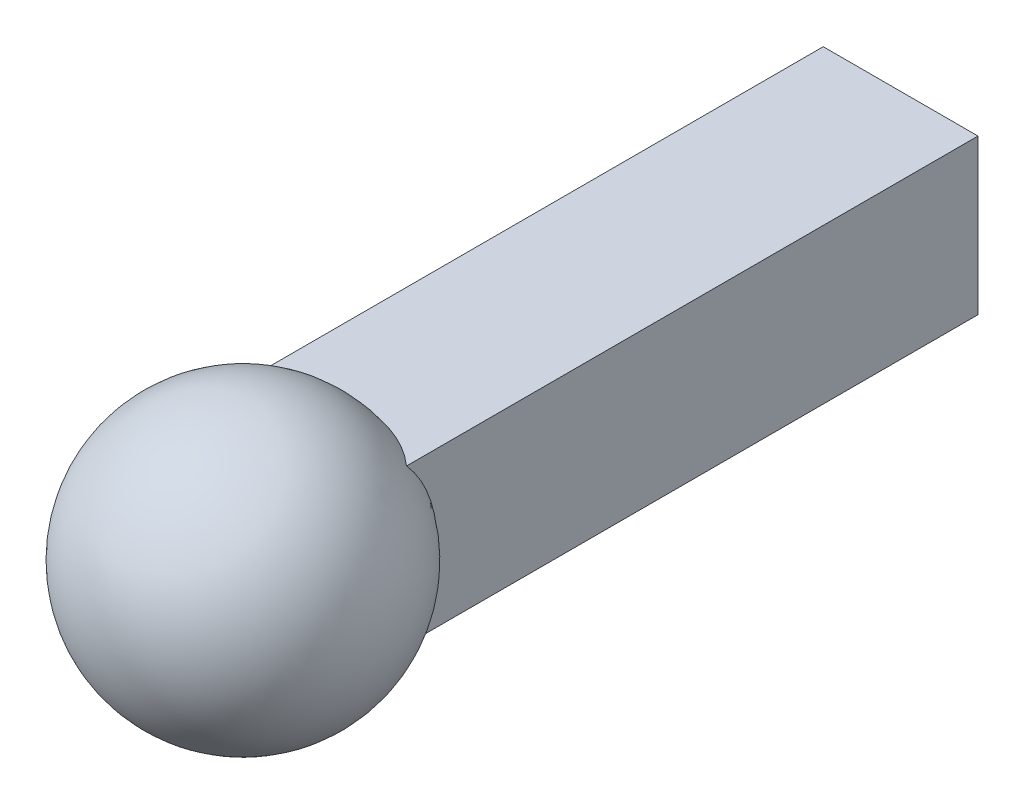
ISO-10303-21;
HEADER;
FILE_DESCRIPTION(('STEP AP214'),'2;1');
FILE_NAME('part.step','',(''),(''),'','','');
FILE_SCHEMA(('AUTOMOTIVE_DESIGN { 1 0 10303 214 1 1 1 1 }'));
ENDSEC;
DATA;
#1=APPLICATION_CONTEXT('core data for automotive mechanical design processes');
#2=APPLICATION_PROTOCOL_DEFINITION('international standard','automotive_design',2000,#1);
#3=PRODUCT_CONTEXT('',#1,'mechanical');
#4=PRODUCT('Part','Part','',(#3));
#5=PRODUCT_RELATED_PRODUCT_CATEGORY('part','',(#4));
#6=PRODUCT_DEFINITION_FORMATION('','',#4);
#7=PRODUCT_DEFINITION_CONTEXT('part definition',#1,'design');
#8=PRODUCT_DEFINITION('design','',#6,#7);
#9=PRODUCT_DEFINITION_SHAPE('','',#8);
#10=(LENGTH_UNIT() NAMED_UNIT(*) SI_UNIT(.MILLI.,.METRE.));
#11=(NAMED_UNIT(*) PLANE_ANGLE_UNIT() SI_UNIT($,.RADIAN.));
#12=(NAMED_UNIT(*) SI_UNIT($,.STERADIAN.) SOLID_ANGLE_UNIT());
#13=UNCERTAINTY_MEASURE_WITH_UNIT(LENGTH_MEASURE(1.E-05),#10,'distance_accuracy_value','');
#14=(GEOMETRIC_REPRESENTATION_CONTEXT(3) GLOBAL_UNCERTAINTY_ASSIGNED_CONTEXT((#13)) GLOBAL_UNIT_ASSIGNED_CONTEXT((#10,
#11,#12)) REPRESENTATION_CONTEXT('',''));
#15=CARTESIAN_POINT('',(0.,0.,0.));
#16=DIRECTION('',(0.,0.,1.));
#17=DIRECTION('',(1.,0.,0.));
#18=AXIS2_PLACEMENT_3D('',#15,#16,#17);
#19=CARTESIAN_POINT('',(5.,5.,-42.5));
#20=DIRECTION('',(0.,1.,0.));
#21=DIRECTION('',(0.,0.,1.));
#22=AXIS2_PLACEMENT_3D('',#19,#20,#21);
#23=PLANE('',#22);
#24=CARTESIAN_POINT('',(0.,5.,0.));
#25=DIRECTION('',(0.,1.,0.));
#26=DIRECTION('',(0.,0.,1.));
#27=AXIS2_PLACEMENT_3D('',#24,#25,#26);
#28=CIRCLE('',#27,7.48331477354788);
#29=CARTESIAN_POINT('',(5.,5.,-5.56776436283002));
#30=VERTEX_POINT('',#29);
#31=CARTESIAN_POINT('',(-5.,5.,-5.56776436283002));
#32=VERTEX_POINT('',#31);
#33=EDGE_CURVE('E11',#30,#32,#28,.T.);
#34=ORIENTED_EDGE('',*,*,#33,.F.);
#35=DIRECTION('',(0.,0.,1.));
#36=VECTOR('',#35,1.);
#37=CARTESIAN_POINT('',(5.,5.,-42.5));
#38=LINE('',#37,#36);
#39=CARTESIAN_POINT('',(5.,5.,-42.5));
#40=VERTEX_POINT('',#39);
#41=EDGE_CURVE('E88',#40,#30,#38,.T.);
#42=ORIENTED_EDGE('',*,*,#41,.F.);
#43=DIRECTION('',(-1.,0.,0.));
#44=VECTOR('',#43,1.);
#45=CARTESIAN_POINT('',(5.,5.,-42.5));
#46=LINE('',#45,#44);
#47=CARTESIAN_POINT('',(-5.,5.,-42.5));
#48=VERTEX_POINT('',#47);
#49=EDGE_CURVE('E83',#40,#48,#46,.T.);
#50=ORIENTED_EDGE('',*,*,#49,.T.);
#51=DIRECTION('',(0.,0.,1.));
#52=VECTOR('',#51,1.);
#53=CARTESIAN_POINT('',(-5.,5.,-42.5));
#54=LINE('',#53,#52);
#55=EDGE_CURVE('E69',#48,#32,#54,.T.);
#56=ORIENTED_EDGE('',*,*,#55,.T.);
#57=EDGE_LOOP('',(#34,#42,#50,#56));
#58=FACE_BOUND('',#57,.T.);
#59=ADVANCED_FACE('F32',(#58),#23,.T.);
#60=CARTESIAN_POINT('',(5.,-5.,-42.5));
#61=DIRECTION('',(1.,0.,0.));
#62=DIRECTION('',(0.,1.,0.));
#63=AXIS2_PLACEMENT_3D('',#60,#61,#62);
#64=PLANE('',#63);
#65=CARTESIAN_POINT('',(5.,0.,0.));
#66=DIRECTION('',(1.,0.,0.));
#67=DIRECTION('',(0.,1.,0.));
#68=AXIS2_PLACEMENT_3D('',#65,#66,#67);
#69=CIRCLE('',#68,7.48331477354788);
#70=CARTESIAN_POINT('',(5.,-5.,-5.56776436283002));
#71=VERTEX_POINT('',#70);
#72=EDGE_CURVE('E40',#71,#30,#69,.T.);
#73=ORIENTED_EDGE('',*,*,#72,.F.);
#74=DIRECTION('',(0.,0.,1.));
#75=VECTOR('',#74,1.);
#76=CARTESIAN_POINT('',(5.,-5.,-42.5));
#77=LINE('',#76,#75);
#78=CARTESIAN_POINT('',(5.,-5.,-42.5));
#79=VERTEX_POINT('',#78);
#80=EDGE_CURVE('E94',#79,#71,#77,.T.);
#81=ORIENTED_EDGE('',*,*,#80,.F.);
#82=DIRECTION('',(0.,1.,0.));
#83=VECTOR('',#82,1.);
#84=CARTESIAN_POINT('',(5.,-5.,-42.5));
#85=LINE('',#84,#83);
#86=EDGE_CURVE('E76',#79,#40,#85,.T.);
#87=ORIENTED_EDGE('',*,*,#86,.T.);
#88=ORIENTED_EDGE('',*,*,#41,.T.);
#89=EDGE_LOOP('',(#73,#81,#87,#88));
#90=FACE_BOUND('',#89,.T.);
#91=ADVANCED_FACE('F104',(#90),#64,.T.);
#92=CARTESIAN_POINT('',(-5.,-5.,-42.5));
#93=DIRECTION('',(0.,-1.,0.));
#94=DIRECTION('',(0.,0.,-1.));
#95=AXIS2_PLACEMENT_3D('',#92,#93,#94);
#96=PLANE('',#95);
#97=CARTESIAN_POINT('',(0.,-5.,0.));
#98=DIRECTION('',(0.,-1.,0.));
#99=DIRECTION('',(0.,0.,-1.));
#100=AXIS2_PLACEMENT_3D('',#97,#98,#99);
#101=CIRCLE('',#100,7.48331477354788);
#102=CARTESIAN_POINT('',(-5.,-5.,-5.56776436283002));
#103=VERTEX_POINT('',#102);
#104=EDGE_CURVE('E99',#103,#71,#101,.T.);
#105=ORIENTED_EDGE('',*,*,#104,.F.);
#106=DIRECTION('',(0.,0.,1.));
#107=VECTOR('',#106,1.);
#108=CARTESIAN_POINT('',(-5.,-5.,-42.5));
#109=LINE('',#108,#107);
#110=CARTESIAN_POINT('',(-5.,-5.,-42.5));
#111=VERTEX_POINT('',#110);
#112=EDGE_CURVE('E47',#111,#103,#109,.T.);
#113=ORIENTED_EDGE('',*,*,#112,.F.);
#114=DIRECTION('',(1.,0.,0.));
#115=VECTOR('',#114,1.);
#116=CARTESIAN_POINT('',(-5.,-5.,-42.5));
#117=LINE('',#116,#115);
#118=EDGE_CURVE('E86',#111,#79,#117,.T.);
#119=ORIENTED_EDGE('',*,*,#118,.T.);
#120=ORIENTED_EDGE('',*,*,#80,.T.);
#121=EDGE_LOOP('',(#105,#113,#119,#120));
#122=FACE_BOUND('',#121,.T.);
#123=ADVANCED_FACE('F106',(#122),#96,.T.);
#124=CARTESIAN_POINT('',(-5.,5.,-42.5));
#125=DIRECTION('',(-1.,0.,0.));
#126=DIRECTION('',(0.,0.,1.));
#127=AXIS2_PLACEMENT_3D('',#124,#125,#126);
#128=PLANE('',#127);
#129=CARTESIAN_POINT('',(-5.,0.,0.));
#130=DIRECTION('',(-1.,0.,0.));
#131=DIRECTION('',(0.,0.,1.));
#132=AXIS2_PLACEMENT_3D('',#129,#130,#131);
#133=CIRCLE('',#132,7.48331477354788);
#134=EDGE_CURVE('E74',#32,#103,#133,.T.);
#135=ORIENTED_EDGE('',*,*,#134,.F.);
#136=ORIENTED_EDGE('',*,*,#55,.F.);
#137=DIRECTION('',(0.,-1.,0.));
#138=VECTOR('',#137,1.);
#139=CARTESIAN_POINT('',(-5.,5.,-42.5));
#140=LINE('',#139,#138);
#141=EDGE_CURVE('E72',#48,#111,#140,.T.);
#142=ORIENTED_EDGE('',*,*,#141,.T.);
#143=ORIENTED_EDGE('',*,*,#112,.T.);
#144=EDGE_LOOP('',(#135,#136,#142,#143));
#145=FACE_BOUND('',#144,.T.);
#146=ADVANCED_FACE('F71',(#145),#128,.T.);
#147=CARTESIAN_POINT('',(0.,0.,-42.5));
#148=DIRECTION('',(0.,0.,1.));
#149=DIRECTION('',(1.,0.,0.));
#150=AXIS2_PLACEMENT_3D('',#147,#148,#149);
#151=PLANE('',#150);
#152=ORIENTED_EDGE('',*,*,#49,.F.);
#153=ORIENTED_EDGE('',*,*,#86,.F.);
#154=ORIENTED_EDGE('',*,*,#118,.F.);
#155=ORIENTED_EDGE('',*,*,#141,.F.);
#156=EDGE_LOOP('',(#152,#153,#154,#155));
#157=FACE_BOUND('',#156,.T.);
#158=ADVANCED_FACE('F81',(#157),#151,.F.);
#159=CARTESIAN_POINT('',(0.,0.,0.));
#160=DIRECTION('',(0.,1.,0.));
#161=DIRECTION('',(0.,0.,-1.));
#162=AXIS2_PLACEMENT_3D('',#159,#160,#161);
#163=SPHERICAL_SURFACE('',#162,9.);
#164=ORIENTED_EDGE('',*,*,#72,.T.);
#165=ORIENTED_EDGE('',*,*,#33,.T.);
#166=ORIENTED_EDGE('',*,*,#134,.T.);
#167=ORIENTED_EDGE('',*,*,#104,.T.);
#168=EDGE_LOOP('',(#164,#165,#166,#167));
#169=FACE_BOUND('',#168,.T.);
#170=ADVANCED_FACE('F34',(#169),#163,.T.);
#171=CLOSED_SHELL('',(#59,#91,#123,#146,#158,#170));
#172=MANIFOLD_SOLID_BREP('B2',#171);
#173=ADVANCED_BREP_SHAPE_REPRESENTATION('',(#18,#172),#14);
#174=SHAPE_DEFINITION_REPRESENTATION(#9,#173);
ENDSEC;
END-ISO-10303-21;
